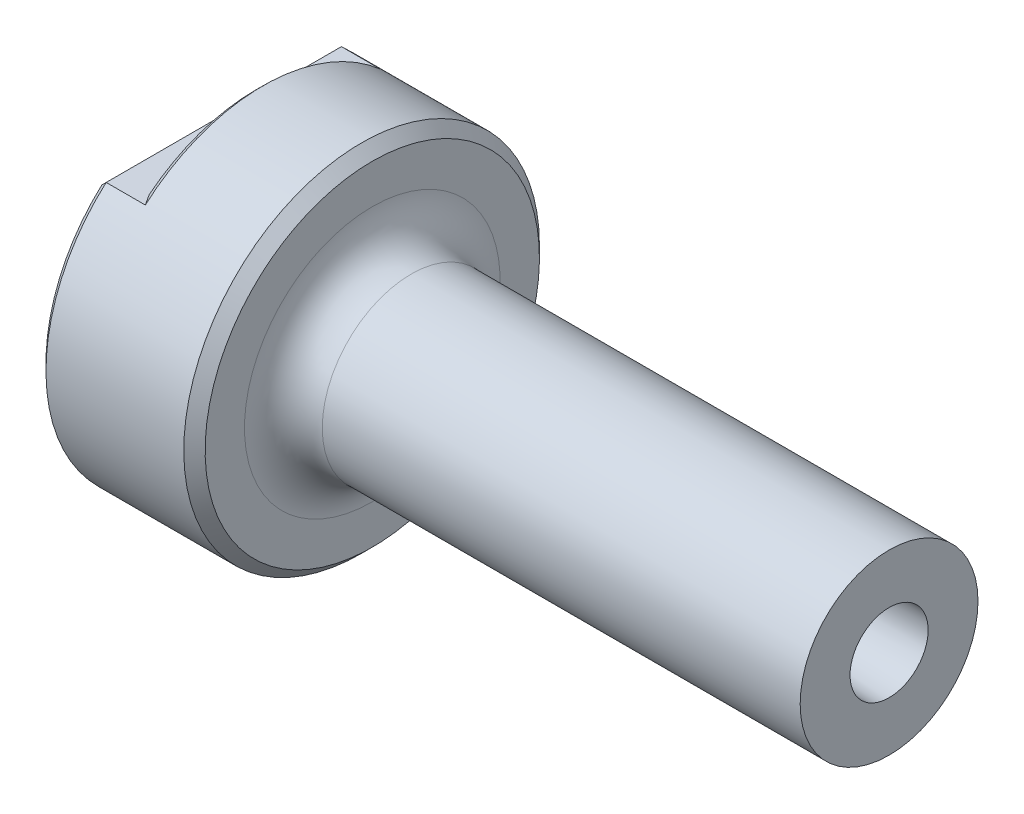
from build123d import *

# Parameters (mm, degrees)
SKETCH1_R           = 25.4
BOSS_EXTRUDE1_DEPTH = 48.021875
SKETCH3_W           = 50.8
SKETCH3_H           = 6.35
CUT_EXTRUDE1_DEPTH  = 5.588
SKETCH5_W           = 73.81875
SKETCH5_H           = 12.7
FILLET1_R           = 5.55625
CHAMFER1_SIZE       = 1.524
CHAMFER2_SIZE       = 1.016


with BuildPart() as part:
    # Sketch1 → Boss-Extrude1 (new, symmetric)
    with BuildSketch(Plane(origin=(0, 0, 0), x_dir=(0, 0, -1), z_dir=(1, 0, 0))):
        Circle(SKETCH1_R)
    extrude(amount=BOSS_EXTRUDE1_DEPTH, both=True)

    # Sketch3 → Cut-Extrude1 (cut)
    with BuildSketch(Plane.ZY.offset(48.021875)):
        with Locations((0, 22.225)):
            Rectangle(SKETCH3_W, SKETCH3_H)
    extrude(amount=-CUT_EXTRUDE1_DEPTH, mode=Mode.SUBTRACT)

    # Sketch5 → Cut-Revolve1 (revolve, cut)
    with BuildSketch(Plane.XY, mode=Mode.PRIVATE) as cut_revolve1_sk:
        with Locations((11.1125, -19.05)):
            Rectangle(SKETCH5_W, SKETCH5_H)
    revolve(cut_revolve1_sk.sketch.rotate(Axis((48.021875, 0, 0), (-1, 0, 0)), 138.590377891), axis=Axis((48.021875, 0, 0), (-1, 0, 0)), mode=Mode.SUBTRACT)

    # Sketch6 → Cut-Revolve2 (revolve, cut)
    with BuildSketch(Plane.XY):
        with BuildLine():
            Line((-43.399075, 0), (-48.021875, 0))
            Line((-48.021875, 0), (-48.021875, 9.800451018))
            ThreePointArc((-48.021875, 9.800451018), (-44.612769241, 5.418005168), (-43.399075, 0))
        make_face()
    revolve(axis=Axis((48.021875, 0, 0), (-1, 0, 0)), mode=Mode.SUBTRACT)

    # Sketch7 → Cut-Revolve3 (revolve, cut)
    with BuildSketch(Plane.XY):
        Polygon((-43.911716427, 3.571875), (48.021875, 5.577873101), (48.021875, 0), (-43.911716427, 0), align=None)
    revolve(axis=Axis((48.021875, 0, 0), (-1, 0, 0)), mode=Mode.SUBTRACT)

    # Fillet1
    fillet1_edges = [part.edges().sort_by_distance(p)[0] for p in [
        (-25.796875, -9.525, -8.400260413),
    ]]
    fillet(fillet1_edges, radius=FILLET1_R)

    # Chamfer1
    chamfer1_edges = [part.edges().sort_by_distance(p)[0] for p in [
        (-25.796875, 0, 25.4),
    ]]
    chamfer(chamfer1_edges, length=CHAMFER1_SIZE)

    # Chamfer2
    chamfer2_edges = [part.edges().sort_by_distance(p)[0] for p in [
        (-48.021875, -23.150520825, 10.450520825),
        (-48.021875, 19.05, 0),
        (-42.433875, 25.4, 0),
    ]]
    chamfer(chamfer2_edges, length=CHAMFER2_SIZE)


solid = part.part
